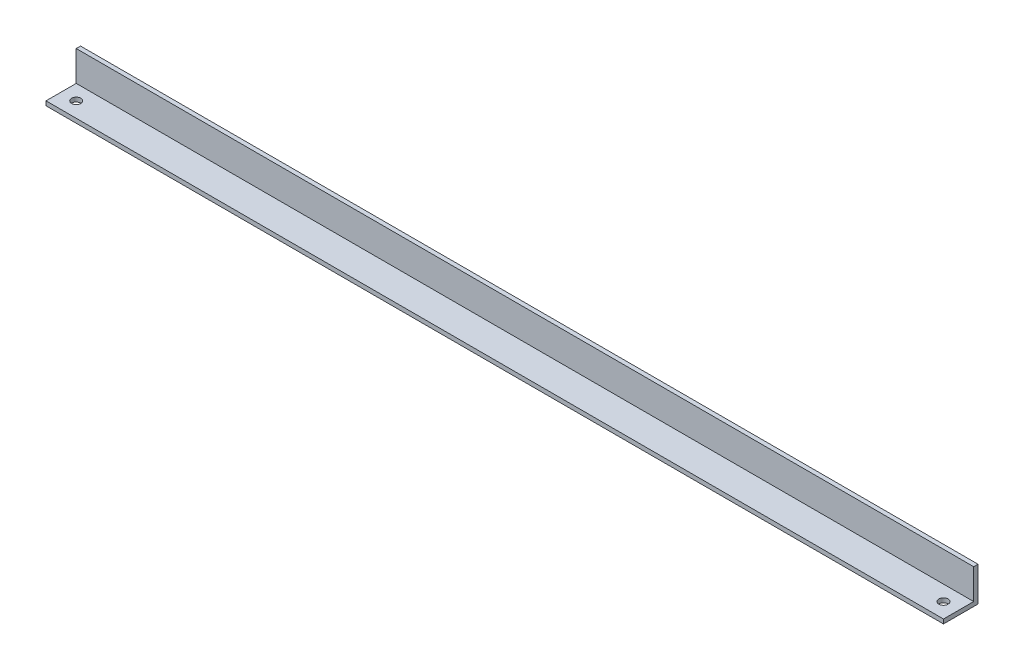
ISO-10303-21;
HEADER;
FILE_DESCRIPTION(('STEP AP214'),'2;1');
FILE_NAME('part.step','',(''),(''),'','','');
FILE_SCHEMA(('AUTOMOTIVE_DESIGN { 1 0 10303 214 1 1 1 1 }'));
ENDSEC;
DATA;
#1=APPLICATION_CONTEXT('core data for automotive mechanical design processes');
#2=APPLICATION_PROTOCOL_DEFINITION('international standard','automotive_design',2000,#1);
#3=PRODUCT_CONTEXT('',#1,'mechanical');
#4=PRODUCT('Part','Part','',(#3));
#5=PRODUCT_RELATED_PRODUCT_CATEGORY('part','',(#4));
#6=PRODUCT_DEFINITION_FORMATION('','',#4);
#7=PRODUCT_DEFINITION_CONTEXT('part definition',#1,'design');
#8=PRODUCT_DEFINITION('design','',#6,#7);
#9=PRODUCT_DEFINITION_SHAPE('','',#8);
#10=(LENGTH_UNIT() NAMED_UNIT(*) SI_UNIT(.MILLI.,.METRE.));
#11=(NAMED_UNIT(*) PLANE_ANGLE_UNIT() SI_UNIT($,.RADIAN.));
#12=(NAMED_UNIT(*) SI_UNIT($,.STERADIAN.) SOLID_ANGLE_UNIT());
#13=UNCERTAINTY_MEASURE_WITH_UNIT(LENGTH_MEASURE(1.E-05),#10,'distance_accuracy_value','');
#14=(GEOMETRIC_REPRESENTATION_CONTEXT(3) GLOBAL_UNCERTAINTY_ASSIGNED_CONTEXT((#13)) GLOBAL_UNIT_ASSIGNED_CONTEXT((#10,
#11,#12)) REPRESENTATION_CONTEXT('',''));
#15=CARTESIAN_POINT('',(0.,0.,0.));
#16=DIRECTION('',(0.,0.,1.));
#17=DIRECTION('',(1.,0.,0.));
#18=AXIS2_PLACEMENT_3D('',#15,#16,#17);
#19=CARTESIAN_POINT('',(330.2,3.175,-12.7));
#20=DIRECTION('',(-1.,0.,0.));
#21=DIRECTION('',(0.,0.,1.));
#22=AXIS2_PLACEMENT_3D('',#19,#20,#21);
#23=PLANE('',#22);
#24=DIRECTION('',(0.,0.,-1.));
#25=VECTOR('',#24,1.);
#26=CARTESIAN_POINT('',(330.2,0.,-12.7));
#27=LINE('',#26,#25);
#28=CARTESIAN_POINT('',(330.2,0.,12.7));
#29=VERTEX_POINT('',#28);
#30=CARTESIAN_POINT('',(330.2,0.,-12.7));
#31=VERTEX_POINT('',#30);
#32=EDGE_CURVE('E89',#29,#31,#27,.T.);
#33=ORIENTED_EDGE('',*,*,#32,.T.);
#34=DIRECTION('',(0.,-1.,0.));
#35=VECTOR('',#34,1.);
#36=CARTESIAN_POINT('',(330.2,3.175,-12.7));
#37=LINE('',#36,#35);
#38=CARTESIAN_POINT('',(330.2,25.4,-12.7));
#39=VERTEX_POINT('',#38);
#40=EDGE_CURVE('E11',#39,#31,#37,.T.);
#41=ORIENTED_EDGE('',*,*,#40,.F.);
#42=DIRECTION('',(0.,0.,-1.));
#43=VECTOR('',#42,1.);
#44=CARTESIAN_POINT('',(330.2,25.4,-9.525));
#45=LINE('',#44,#43);
#46=CARTESIAN_POINT('',(330.2,25.4,-9.525));
#47=VERTEX_POINT('',#46);
#48=EDGE_CURVE('E115',#47,#39,#45,.T.);
#49=ORIENTED_EDGE('',*,*,#48,.F.);
#50=DIRECTION('',(0.,-1.,0.));
#51=VECTOR('',#50,1.);
#52=CARTESIAN_POINT('',(330.2,25.4,-9.525));
#53=LINE('',#52,#51);
#54=CARTESIAN_POINT('',(330.2,3.175,-9.525));
#55=VERTEX_POINT('',#54);
#56=EDGE_CURVE('E98',#47,#55,#53,.T.);
#57=ORIENTED_EDGE('',*,*,#56,.T.);
#58=DIRECTION('',(0.,0.,-1.));
#59=VECTOR('',#58,1.);
#60=CARTESIAN_POINT('',(330.2,3.175,-12.7));
#61=LINE('',#60,#59);
#62=CARTESIAN_POINT('',(330.2,3.175,12.7));
#63=VERTEX_POINT('',#62);
#64=EDGE_CURVE('E83',#63,#55,#61,.T.);
#65=ORIENTED_EDGE('',*,*,#64,.F.);
#66=DIRECTION('',(0.,-1.,0.));
#67=VECTOR('',#66,1.);
#68=CARTESIAN_POINT('',(330.2,3.175,12.7));
#69=LINE('',#68,#67);
#70=EDGE_CURVE('E76',#63,#29,#69,.T.);
#71=ORIENTED_EDGE('',*,*,#70,.T.);
#72=EDGE_LOOP('',(#33,#41,#49,#57,#65,#71));
#73=FACE_BOUND('',#72,.T.);
#74=ADVANCED_FACE('F32',(#73),#23,.F.);
#75=CARTESIAN_POINT('',(-330.2,3.175,-12.7));
#76=DIRECTION('',(0.,0.,1.));
#77=DIRECTION('',(1.,0.,0.));
#78=AXIS2_PLACEMENT_3D('',#75,#76,#77);
#79=PLANE('',#78);
#80=DIRECTION('',(-1.,0.,0.));
#81=VECTOR('',#80,1.);
#82=CARTESIAN_POINT('',(-330.2,0.,-12.7));
#83=LINE('',#82,#81);
#84=CARTESIAN_POINT('',(-330.2,0.,-12.7));
#85=VERTEX_POINT('',#84);
#86=EDGE_CURVE('E93',#31,#85,#83,.T.);
#87=ORIENTED_EDGE('',*,*,#86,.T.);
#88=DIRECTION('',(0.,-1.,0.));
#89=VECTOR('',#88,1.);
#90=CARTESIAN_POINT('',(-330.2,3.175,-12.7));
#91=LINE('',#90,#89);
#92=CARTESIAN_POINT('',(-330.2,25.4,-12.7));
#93=VERTEX_POINT('',#92);
#94=EDGE_CURVE('E40',#93,#85,#91,.T.);
#95=ORIENTED_EDGE('',*,*,#94,.F.);
#96=DIRECTION('',(-1.,0.,0.));
#97=VECTOR('',#96,1.);
#98=CARTESIAN_POINT('',(330.2,25.4,-12.7));
#99=LINE('',#98,#97);
#100=EDGE_CURVE('E118',#39,#93,#99,.T.);
#101=ORIENTED_EDGE('',*,*,#100,.F.);
#102=ORIENTED_EDGE('',*,*,#40,.T.);
#103=EDGE_LOOP('',(#87,#95,#101,#102));
#104=FACE_BOUND('',#103,.T.);
#105=ADVANCED_FACE('F176',(#104),#79,.F.);
#106=CARTESIAN_POINT('',(-330.2,3.175,-12.7));
#107=DIRECTION('',(1.,0.,0.));
#108=DIRECTION('',(0.,0.,-1.));
#109=AXIS2_PLACEMENT_3D('',#106,#107,#108);
#110=PLANE('',#109);
#111=DIRECTION('',(0.,0.,1.));
#112=VECTOR('',#111,1.);
#113=CARTESIAN_POINT('',(-330.2,0.,-12.7));
#114=LINE('',#113,#112);
#115=CARTESIAN_POINT('',(-330.2,0.,12.7));
#116=VERTEX_POINT('',#115);
#117=EDGE_CURVE('E84',#85,#116,#114,.T.);
#118=ORIENTED_EDGE('',*,*,#117,.T.);
#119=DIRECTION('',(0.,-1.,0.));
#120=VECTOR('',#119,1.);
#121=CARTESIAN_POINT('',(-330.2,3.175,12.7));
#122=LINE('',#121,#120);
#123=CARTESIAN_POINT('',(-330.2,3.175,12.7));
#124=VERTEX_POINT('',#123);
#125=EDGE_CURVE('E79',#124,#116,#122,.T.);
#126=ORIENTED_EDGE('',*,*,#125,.F.);
#127=DIRECTION('',(0.,0.,1.));
#128=VECTOR('',#127,1.);
#129=CARTESIAN_POINT('',(-330.2,3.175,-12.7));
#130=LINE('',#129,#128);
#131=CARTESIAN_POINT('',(-330.2,3.175,-9.525));
#132=VERTEX_POINT('',#131);
#133=EDGE_CURVE('E108',#132,#124,#130,.T.);
#134=ORIENTED_EDGE('',*,*,#133,.F.);
#135=DIRECTION('',(0.,-1.,0.));
#136=VECTOR('',#135,1.);
#137=CARTESIAN_POINT('',(-330.2,25.4,-9.525));
#138=LINE('',#137,#136);
#139=CARTESIAN_POINT('',(-330.2,25.4,-9.525));
#140=VERTEX_POINT('',#139);
#141=EDGE_CURVE('E94',#140,#132,#138,.T.);
#142=ORIENTED_EDGE('',*,*,#141,.F.);
#143=DIRECTION('',(0.,0.,1.));
#144=VECTOR('',#143,1.);
#145=CARTESIAN_POINT('',(-330.2,25.4,-12.7));
#146=LINE('',#145,#144);
#147=EDGE_CURVE('E131',#93,#140,#146,.T.);
#148=ORIENTED_EDGE('',*,*,#147,.F.);
#149=ORIENTED_EDGE('',*,*,#94,.T.);
#150=EDGE_LOOP('',(#118,#126,#134,#142,#148,#149));
#151=FACE_BOUND('',#150,.T.);
#152=ADVANCED_FACE('F180',(#151),#110,.F.);
#153=CARTESIAN_POINT('',(-330.2,3.175,12.7));
#154=DIRECTION('',(0.,0.,-1.));
#155=DIRECTION('',(-1.,0.,0.));
#156=AXIS2_PLACEMENT_3D('',#153,#154,#155);
#157=PLANE('',#156);
#158=DIRECTION('',(1.,0.,0.));
#159=VECTOR('',#158,1.);
#160=CARTESIAN_POINT('',(-330.2,0.,12.7));
#161=LINE('',#160,#159);
#162=EDGE_CURVE('E73',#116,#29,#161,.T.);
#163=ORIENTED_EDGE('',*,*,#162,.T.);
#164=ORIENTED_EDGE('',*,*,#70,.F.);
#165=DIRECTION('',(1.,0.,0.));
#166=VECTOR('',#165,1.);
#167=CARTESIAN_POINT('',(-330.2,3.175,12.7));
#168=LINE('',#167,#166);
#169=EDGE_CURVE('E54',#124,#63,#168,.T.);
#170=ORIENTED_EDGE('',*,*,#169,.F.);
#171=ORIENTED_EDGE('',*,*,#125,.T.);
#172=EDGE_LOOP('',(#163,#164,#170,#171));
#173=FACE_BOUND('',#172,.T.);
#174=ADVANCED_FACE('F75',(#173),#157,.F.);
#175=CARTESIAN_POINT('',(330.2,3.175,12.7));
#176=DIRECTION('',(0.,1.,0.));
#177=DIRECTION('',(0.,0.,1.));
#178=AXIS2_PLACEMENT_3D('',#175,#176,#177);
#179=PLANE('',#178);
#180=CARTESIAN_POINT('',(319.0875,3.175,1.5875));
#181=DIRECTION('',(0.,1.,0.));
#182=DIRECTION('',(0.,0.,1.));
#183=AXIS2_PLACEMENT_3D('',#180,#181,#182);
#184=CIRCLE('',#183,3.37819999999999);
#185=CARTESIAN_POINT('',(319.0875,3.175,4.96569999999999));
#186=VERTEX_POINT('',#185);
#187=EDGE_CURVE('E144',#186,#186,#184,.T.);
#188=ORIENTED_EDGE('',*,*,#187,.F.);
#189=EDGE_LOOP('',(#188));
#190=FACE_BOUND('',#189,.T.);
#191=CARTESIAN_POINT('',(-319.0875,3.175,1.5875));
#192=DIRECTION('',(0.,1.,0.));
#193=DIRECTION('',(0.,0.,1.));
#194=AXIS2_PLACEMENT_3D('',#191,#192,#193);
#195=CIRCLE('',#194,3.37819999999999);
#196=CARTESIAN_POINT('',(-319.0875,3.175,4.96569999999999));
#197=VERTEX_POINT('',#196);
#198=EDGE_CURVE('E138',#197,#197,#195,.T.);
#199=ORIENTED_EDGE('',*,*,#198,.F.);
#200=EDGE_LOOP('',(#199));
#201=FACE_BOUND('',#200,.T.);
#202=DIRECTION('',(1.,0.,0.));
#203=VECTOR('',#202,1.);
#204=CARTESIAN_POINT('',(-330.2,3.175,-9.525));
#205=LINE('',#204,#203);
#206=EDGE_CURVE('E48',#132,#55,#205,.T.);
#207=ORIENTED_EDGE('',*,*,#206,.F.);
#208=ORIENTED_EDGE('',*,*,#133,.T.);
#209=ORIENTED_EDGE('',*,*,#169,.T.);
#210=ORIENTED_EDGE('',*,*,#64,.T.);
#211=EDGE_LOOP('',(#207,#208,#209,#210));
#212=FACE_BOUND('',#211,.T.);
#213=ADVANCED_FACE('F159',(#190,#201,#212),#179,.T.);
#214=CARTESIAN_POINT('',(330.2,0.,12.7));
#215=DIRECTION('',(0.,1.,0.));
#216=DIRECTION('',(0.,0.,1.));
#217=AXIS2_PLACEMENT_3D('',#214,#215,#216);
#218=PLANE('',#217);
#219=CARTESIAN_POINT('',(319.0875,0.,1.5875));
#220=DIRECTION('',(0.,1.,0.));
#221=DIRECTION('',(0.,0.,1.));
#222=AXIS2_PLACEMENT_3D('',#219,#220,#221);
#223=CIRCLE('',#222,3.37819999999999);
#224=CARTESIAN_POINT('',(319.0875,0.,4.96569999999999));
#225=VERTEX_POINT('',#224);
#226=EDGE_CURVE('E141',#225,#225,#223,.T.);
#227=ORIENTED_EDGE('',*,*,#226,.T.);
#228=EDGE_LOOP('',(#227));
#229=FACE_BOUND('',#228,.T.);
#230=CARTESIAN_POINT('',(-319.0875,0.,1.5875));
#231=DIRECTION('',(0.,1.,0.));
#232=DIRECTION('',(0.,0.,1.));
#233=AXIS2_PLACEMENT_3D('',#230,#231,#232);
#234=CIRCLE('',#233,3.37819999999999);
#235=CARTESIAN_POINT('',(-319.0875,0.,4.96569999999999));
#236=VERTEX_POINT('',#235);
#237=EDGE_CURVE('E119',#236,#236,#234,.T.);
#238=ORIENTED_EDGE('',*,*,#237,.T.);
#239=EDGE_LOOP('',(#238));
#240=FACE_BOUND('',#239,.T.);
#241=ORIENTED_EDGE('',*,*,#32,.F.);
#242=ORIENTED_EDGE('',*,*,#162,.F.);
#243=ORIENTED_EDGE('',*,*,#117,.F.);
#244=ORIENTED_EDGE('',*,*,#86,.F.);
#245=EDGE_LOOP('',(#241,#242,#243,#244));
#246=FACE_BOUND('',#245,.T.);
#247=ADVANCED_FACE('F92',(#229,#240,#246),#218,.F.);
#248=CARTESIAN_POINT('',(-330.2,25.4,-9.525));
#249=DIRECTION('',(0.,0.,-1.));
#250=DIRECTION('',(-1.,0.,0.));
#251=AXIS2_PLACEMENT_3D('',#248,#249,#250);
#252=PLANE('',#251);
#253=ORIENTED_EDGE('',*,*,#206,.T.);
#254=ORIENTED_EDGE('',*,*,#56,.F.);
#255=DIRECTION('',(1.,0.,0.));
#256=VECTOR('',#255,1.);
#257=CARTESIAN_POINT('',(-330.2,25.4,-9.525));
#258=LINE('',#257,#256);
#259=EDGE_CURVE('E126',#140,#47,#258,.T.);
#260=ORIENTED_EDGE('',*,*,#259,.F.);
#261=ORIENTED_EDGE('',*,*,#141,.T.);
#262=EDGE_LOOP('',(#253,#254,#260,#261));
#263=FACE_BOUND('',#262,.T.);
#264=ADVANCED_FACE('F172',(#263),#252,.F.);
#265=CARTESIAN_POINT('',(-330.2,25.4,-12.7));
#266=DIRECTION('',(0.,1.,0.));
#267=DIRECTION('',(0.,0.,1.));
#268=AXIS2_PLACEMENT_3D('',#265,#266,#267);
#269=PLANE('',#268);
#270=ORIENTED_EDGE('',*,*,#100,.T.);
#271=ORIENTED_EDGE('',*,*,#147,.T.);
#272=ORIENTED_EDGE('',*,*,#259,.T.);
#273=ORIENTED_EDGE('',*,*,#48,.T.);
#274=EDGE_LOOP('',(#270,#271,#272,#273));
#275=FACE_BOUND('',#274,.T.);
#276=ADVANCED_FACE('F166',(#275),#269,.T.);
#277=CARTESIAN_POINT('',(-319.0875,0.,1.5875));
#278=DIRECTION('',(0.,1.,0.));
#279=DIRECTION('',(0.,0.,1.));
#280=AXIS2_PLACEMENT_3D('',#277,#278,#279);
#281=CYLINDRICAL_SURFACE('',#280,3.37819999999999);
#282=ORIENTED_EDGE('',*,*,#237,.F.);
#283=EDGE_LOOP('',(#282));
#284=FACE_BOUND('',#283,.T.);
#285=ORIENTED_EDGE('',*,*,#198,.T.);
#286=EDGE_LOOP('',(#285));
#287=FACE_BOUND('',#286,.T.);
#288=ADVANCED_FACE('F155',(#284,#287),#281,.F.);
#289=CARTESIAN_POINT('',(319.0875,0.,1.5875));
#290=DIRECTION('',(0.,1.,0.));
#291=DIRECTION('',(0.,0.,1.));
#292=AXIS2_PLACEMENT_3D('',#289,#290,#291);
#293=CYLINDRICAL_SURFACE('',#292,3.37819999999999);
#294=ORIENTED_EDGE('',*,*,#226,.F.);
#295=EDGE_LOOP('',(#294));
#296=FACE_BOUND('',#295,.T.);
#297=ORIENTED_EDGE('',*,*,#187,.T.);
#298=EDGE_LOOP('',(#297));
#299=FACE_BOUND('',#298,.T.);
#300=ADVANCED_FACE('F152',(#296,#299),#293,.F.);
#301=CLOSED_SHELL('',(#74,#105,#152,#174,#213,#247,#264,#276,#288,#300));
#302=MANIFOLD_SOLID_BREP('B2',#301);
#303=ADVANCED_BREP_SHAPE_REPRESENTATION('',(#18,#302),#14);
#304=SHAPE_DEFINITION_REPRESENTATION(#9,#303);
ENDSEC;
END-ISO-10303-21;
